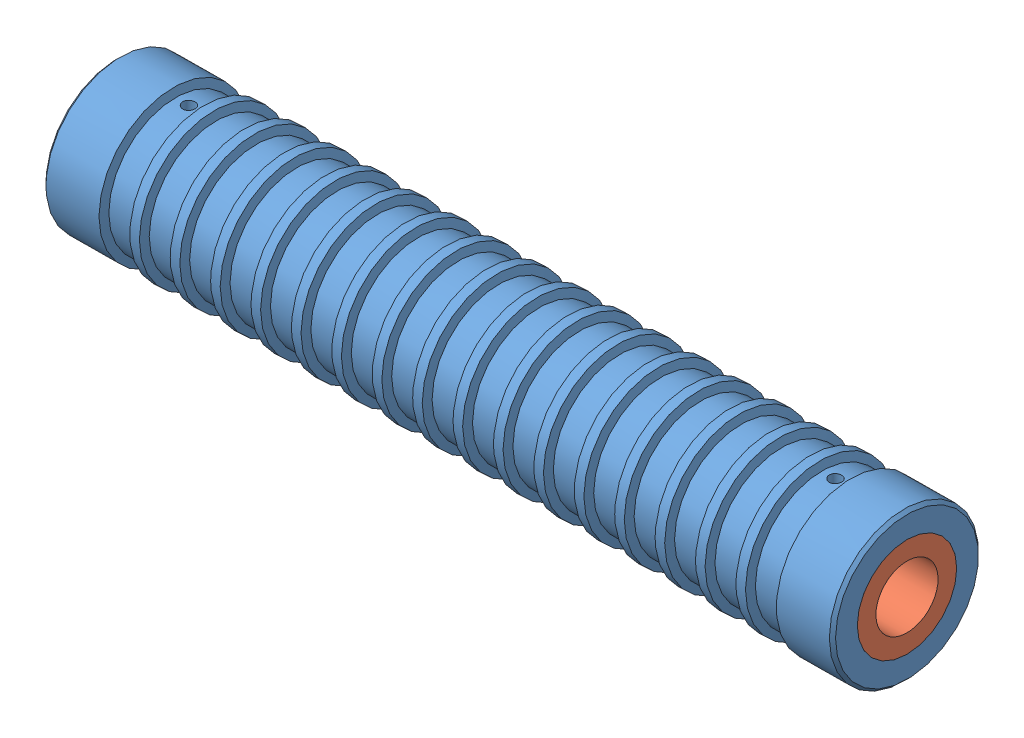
SolidWorks assembly Antriebsrolle_00377364.SLDASM, configuration Standard (file format 4700). Lengths in mm.
Overall size (127 24 24).
3 component instances, 2 part files, 4 mates.
Components (placement in the parent):
- Antriebsrolle_00377225-1: Antriebsrolle_00377225.SLDPRT [Standard] at origin size (127 24 24)
- Buchse_00377350-1: Buchse_00377350.SLDPRT [Standard] at (-47.5 0 0) x (-1 0 0) z (0 -0.010944 -0.99994) size (16 16 16)
- Buchse_00377350-2: Buchse_00377350.SLDPRT [Standard] at (47.5 0 0) x (1 0 0) z (0 -0.343137 0.939285) size (16 16 16)
Mates (geometry in assembly coordinates):
- Konzentrisch1: concentric anti-aligned: cylinder of Antriebsrolle_00377225-1 through (-63.5 0 0) axis (-1 0 0) radius 8; cylinder of Buchse_00377350-1 through (-47.5 0 0) axis (1 0 0) radius 8
- Konzentrisch3: concentric aligned: cylinder of Antriebsrolle_00377225-1 through (-63.5 0 0) axis (-1 0 0) radius 8; cylinder of Buchse_00377350-2 through (47.5 0 0) axis (-1 0 0) radius 8
- Deckungsgleich2: coincident anti-aligned: plane of Antriebsrolle_00377225-1 through (47.5 7.5 0) normal (1 0 0); plane of Buchse_00377350-2 through (47.5 4.6964 1.7157) normal (-1 0 0)
- Deckungsgleich3: coincident anti-aligned: plane of Antriebsrolle_00377225-1 through (-47.5 8 0) normal (-1 0 0); plane of Buchse_00377350-1 through (-47.5 4.9997 -0.0547) normal (1 0 0)
